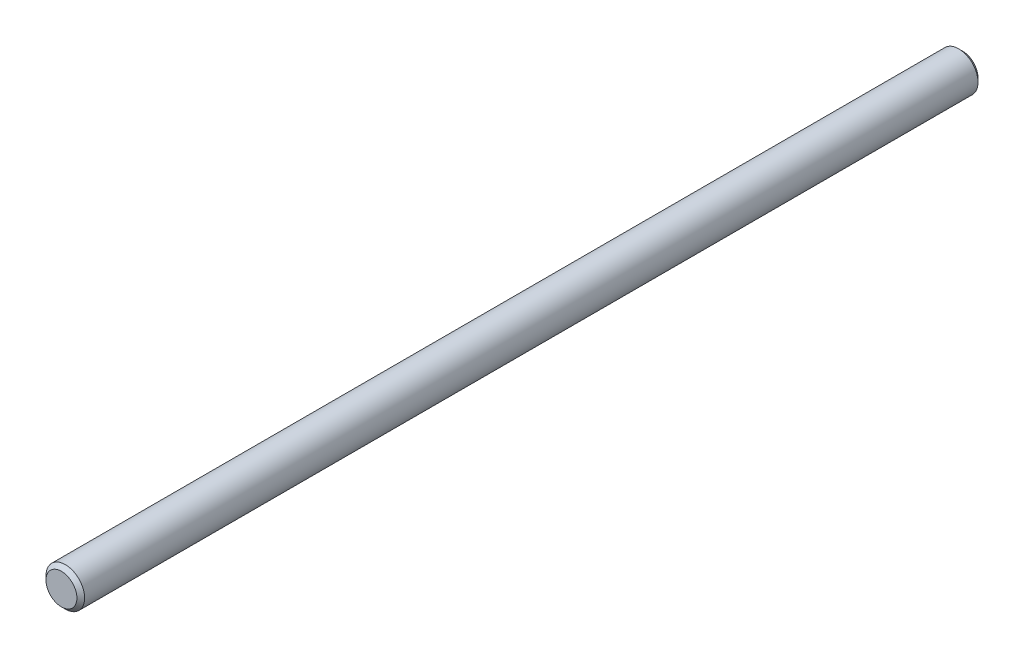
ISO-10303-21;
HEADER;
FILE_DESCRIPTION(('STEP AP214'),'2;1');
FILE_NAME('part.step','',(''),(''),'','','');
FILE_SCHEMA(('AUTOMOTIVE_DESIGN { 1 0 10303 214 1 1 1 1 }'));
ENDSEC;
DATA;
#1=APPLICATION_CONTEXT('core data for automotive mechanical design processes');
#2=APPLICATION_PROTOCOL_DEFINITION('international standard','automotive_design',2000,#1);
#3=PRODUCT_CONTEXT('',#1,'mechanical');
#4=PRODUCT('Part','Part','',(#3));
#5=PRODUCT_RELATED_PRODUCT_CATEGORY('part','',(#4));
#6=PRODUCT_DEFINITION_FORMATION('','',#4);
#7=PRODUCT_DEFINITION_CONTEXT('part definition',#1,'design');
#8=PRODUCT_DEFINITION('design','',#6,#7);
#9=PRODUCT_DEFINITION_SHAPE('','',#8);
#10=(LENGTH_UNIT() NAMED_UNIT(*) SI_UNIT(.MILLI.,.METRE.));
#11=(NAMED_UNIT(*) PLANE_ANGLE_UNIT() SI_UNIT($,.RADIAN.));
#12=(NAMED_UNIT(*) SI_UNIT($,.STERADIAN.) SOLID_ANGLE_UNIT());
#13=UNCERTAINTY_MEASURE_WITH_UNIT(LENGTH_MEASURE(1.E-05),#10,'distance_accuracy_value','');
#14=(GEOMETRIC_REPRESENTATION_CONTEXT(3) GLOBAL_UNCERTAINTY_ASSIGNED_CONTEXT((#13)) GLOBAL_UNIT_ASSIGNED_CONTEXT((#10,
#11,#12)) REPRESENTATION_CONTEXT('',''));
#15=CARTESIAN_POINT('',(0.,0.,0.));
#16=DIRECTION('',(0.,0.,1.));
#17=DIRECTION('',(1.,0.,0.));
#18=AXIS2_PLACEMENT_3D('',#15,#16,#17);
#19=CARTESIAN_POINT('',(0.,0.,70.));
#20=DIRECTION('',(0.,0.,-1.));
#21=DIRECTION('',(-1.,0.,0.));
#22=AXIS2_PLACEMENT_3D('',#19,#20,#21);
#23=CYLINDRICAL_SURFACE('',#22,1.5);
#24=CARTESIAN_POINT('',(0.,0.,0.300000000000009));
#25=DIRECTION('',(0.,0.,1.));
#26=DIRECTION('',(1.,0.,0.));
#27=AXIS2_PLACEMENT_3D('',#24,#25,#26);
#28=CIRCLE('',#27,1.5);
#29=CARTESIAN_POINT('',(1.5,0.,0.300000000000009));
#30=VERTEX_POINT('',#29);
#31=EDGE_CURVE('E36',#30,#30,#28,.T.);
#32=ORIENTED_EDGE('',*,*,#31,.T.);
#33=EDGE_LOOP('',(#32));
#34=FACE_BOUND('',#33,.T.);
#35=CARTESIAN_POINT('',(0.,0.,69.7));
#36=DIRECTION('',(0.,0.,1.));
#37=DIRECTION('',(1.,0.,0.));
#38=AXIS2_PLACEMENT_3D('',#35,#36,#37);
#39=CIRCLE('',#38,1.5);
#40=CARTESIAN_POINT('',(1.5,0.,69.7));
#41=VERTEX_POINT('',#40);
#42=EDGE_CURVE('E40',#41,#41,#39,.F.);
#43=ORIENTED_EDGE('',*,*,#42,.T.);
#44=EDGE_LOOP('',(#43));
#45=FACE_BOUND('',#44,.T.);
#46=ADVANCED_FACE('F26',(#34,#45),#23,.T.);
#47=CARTESIAN_POINT('',(0.,0.,70.));
#48=DIRECTION('',(0.,0.,1.));
#49=DIRECTION('',(1.,0.,0.));
#50=AXIS2_PLACEMENT_3D('',#47,#48,#49);
#51=PLANE('',#50);
#52=CARTESIAN_POINT('',(0.,0.,70.));
#53=DIRECTION('',(0.,0.,1.));
#54=DIRECTION('',(1.,0.,0.));
#55=AXIS2_PLACEMENT_3D('',#52,#53,#54);
#56=CIRCLE('',#55,1.20000000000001);
#57=CARTESIAN_POINT('',(1.20000000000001,0.,70.));
#58=VERTEX_POINT('',#57);
#59=EDGE_CURVE('E10',#58,#58,#56,.T.);
#60=ORIENTED_EDGE('',*,*,#59,.T.);
#61=EDGE_LOOP('',(#60));
#62=FACE_BOUND('',#61,.T.);
#63=ADVANCED_FACE('F59',(#62),#51,.T.);
#64=CARTESIAN_POINT('',(0.,0.,0.));
#65=DIRECTION('',(0.,0.,1.));
#66=DIRECTION('',(1.,0.,0.));
#67=AXIS2_PLACEMENT_3D('',#64,#65,#66);
#68=PLANE('',#67);
#69=CARTESIAN_POINT('',(0.,0.,0.));
#70=DIRECTION('',(0.,0.,1.));
#71=DIRECTION('',(1.,0.,0.));
#72=AXIS2_PLACEMENT_3D('',#69,#70,#71);
#73=CIRCLE('',#72,1.19999999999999);
#74=CARTESIAN_POINT('',(1.19999999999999,0.,0.));
#75=VERTEX_POINT('',#74);
#76=EDGE_CURVE('E32',#75,#75,#73,.F.);
#77=ORIENTED_EDGE('',*,*,#76,.T.);
#78=EDGE_LOOP('',(#77));
#79=FACE_BOUND('',#78,.T.);
#80=ADVANCED_FACE('F55',(#79),#68,.F.);
#81=CARTESIAN_POINT('',(0.,0.,0.300000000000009));
#82=DIRECTION('',(0.,0.,1.));
#83=DIRECTION('',(1.,0.,0.));
#84=AXIS2_PLACEMENT_3D('',#81,#82,#83);
#85=CONICAL_SURFACE('',#84,1.5,0.785398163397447);
#86=ORIENTED_EDGE('',*,*,#76,.F.);
#87=EDGE_LOOP('',(#86));
#88=FACE_BOUND('',#87,.T.);
#89=ORIENTED_EDGE('',*,*,#31,.F.);
#90=EDGE_LOOP('',(#89));
#91=FACE_BOUND('',#90,.T.);
#92=ADVANCED_FACE('F50',(#88,#91),#85,.T.);
#93=CARTESIAN_POINT('',(0.,0.,70.));
#94=DIRECTION('',(0.,0.,-1.));
#95=DIRECTION('',(-1.,0.,0.));
#96=AXIS2_PLACEMENT_3D('',#93,#94,#95);
#97=CONICAL_SURFACE('',#96,1.20000000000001,0.785398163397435);
#98=ORIENTED_EDGE('',*,*,#42,.F.);
#99=EDGE_LOOP('',(#98));
#100=FACE_BOUND('',#99,.T.);
#101=ORIENTED_EDGE('',*,*,#59,.F.);
#102=EDGE_LOOP('',(#101));
#103=FACE_BOUND('',#102,.T.);
#104=ADVANCED_FACE('F47',(#100,#103),#97,.T.);
#105=CLOSED_SHELL('',(#46,#63,#80,#92,#104));
#106=MANIFOLD_SOLID_BREP('B2',#105);
#107=ADVANCED_BREP_SHAPE_REPRESENTATION('',(#18,#106),#14);
#108=SHAPE_DEFINITION_REPRESENTATION(#9,#107);
ENDSEC;
END-ISO-10303-21;
